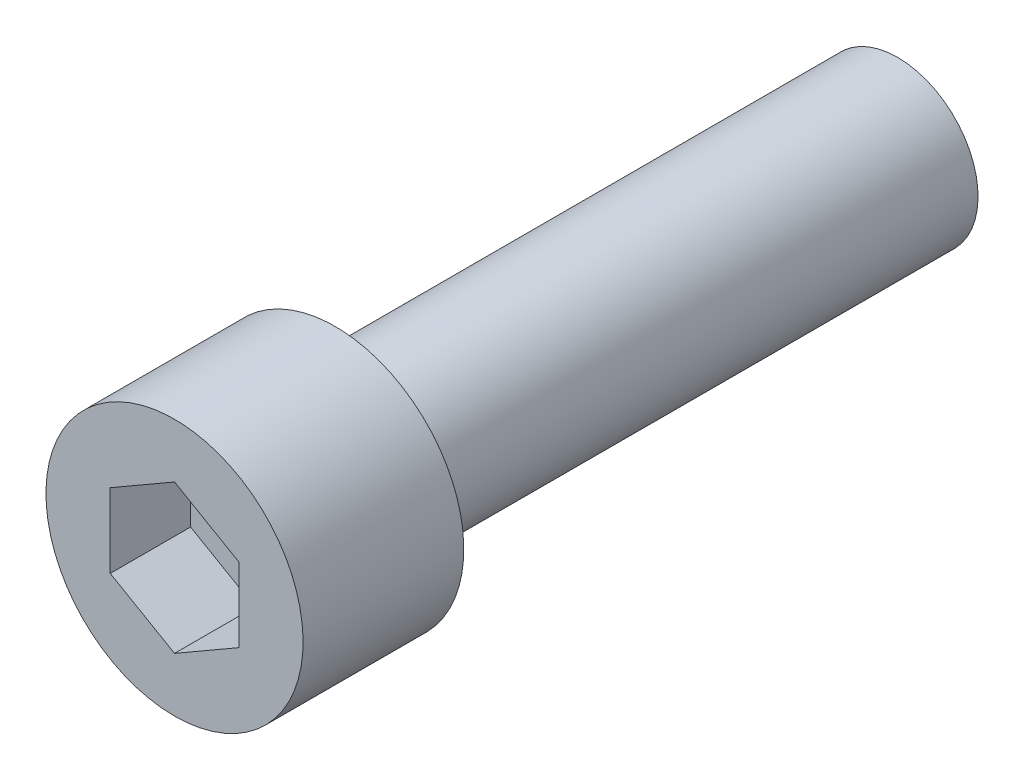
ISO-10303-21;
HEADER;
FILE_DESCRIPTION(('STEP AP214'),'2;1');
FILE_NAME('part.step','',(''),(''),'','','');
FILE_SCHEMA(('AUTOMOTIVE_DESIGN { 1 0 10303 214 1 1 1 1 }'));
ENDSEC;
DATA;
#1=APPLICATION_CONTEXT('core data for automotive mechanical design processes');
#2=APPLICATION_PROTOCOL_DEFINITION('international standard','automotive_design',2000,#1);
#3=PRODUCT_CONTEXT('',#1,'mechanical');
#4=PRODUCT('Part','Part','',(#3));
#5=PRODUCT_RELATED_PRODUCT_CATEGORY('part','',(#4));
#6=PRODUCT_DEFINITION_FORMATION('','',#4);
#7=PRODUCT_DEFINITION_CONTEXT('part definition',#1,'design');
#8=PRODUCT_DEFINITION('design','',#6,#7);
#9=PRODUCT_DEFINITION_SHAPE('','',#8);
#10=(LENGTH_UNIT() NAMED_UNIT(*) SI_UNIT(.MILLI.,.METRE.));
#11=(NAMED_UNIT(*) PLANE_ANGLE_UNIT() SI_UNIT($,.RADIAN.));
#12=(NAMED_UNIT(*) SI_UNIT($,.STERADIAN.) SOLID_ANGLE_UNIT());
#13=UNCERTAINTY_MEASURE_WITH_UNIT(LENGTH_MEASURE(1.E-05),#10,'distance_accuracy_value','');
#14=(GEOMETRIC_REPRESENTATION_CONTEXT(3) GLOBAL_UNCERTAINTY_ASSIGNED_CONTEXT((#13)) GLOBAL_UNIT_ASSIGNED_CONTEXT((#10,
#11,#12)) REPRESENTATION_CONTEXT('',''));
#15=CARTESIAN_POINT('',(0.,0.,0.));
#16=DIRECTION('',(0.,0.,1.));
#17=DIRECTION('',(1.,0.,0.));
#18=AXIS2_PLACEMENT_3D('',#15,#16,#17);
#19=CARTESIAN_POINT('',(0.,0.,0.));
#20=DIRECTION('',(0.,0.,-1.));
#21=DIRECTION('',(0.,1.,0.));
#22=AXIS2_PLACEMENT_3D('',#19,#20,#21);
#23=CYLINDRICAL_SURFACE('',#22,5.);
#24=CARTESIAN_POINT('',(0.,0.,0.));
#25=DIRECTION('',(0.,0.,1.));
#26=DIRECTION('',(0.,-1.,0.));
#27=AXIS2_PLACEMENT_3D('',#24,#25,#26);
#28=CIRCLE('',#27,5.);
#29=CARTESIAN_POINT('',(0.,-5.,0.));
#30=VERTEX_POINT('',#29);
#31=EDGE_CURVE('E9',#30,#30,#28,.T.);
#32=ORIENTED_EDGE('',*,*,#31,.F.);
#33=EDGE_LOOP('',(#32));
#34=FACE_BOUND('',#33,.T.);
#35=CARTESIAN_POINT('',(0.,0.,-35.));
#36=DIRECTION('',(0.,0.,-1.));
#37=DIRECTION('',(0.,1.,0.));
#38=AXIS2_PLACEMENT_3D('',#35,#36,#37);
#39=CIRCLE('',#38,5.);
#40=CARTESIAN_POINT('',(0.,5.,-35.));
#41=VERTEX_POINT('',#40);
#42=EDGE_CURVE('E143',#41,#41,#39,.T.);
#43=ORIENTED_EDGE('',*,*,#42,.F.);
#44=EDGE_LOOP('',(#43));
#45=FACE_BOUND('',#44,.T.);
#46=ADVANCED_FACE('F15',(#34,#45),#23,.T.);
#47=CARTESIAN_POINT('',(0.,0.,0.));
#48=DIRECTION('',(0.,0.,1.));
#49=DIRECTION('',(0.,-1.,0.));
#50=AXIS2_PLACEMENT_3D('',#47,#48,#49);
#51=PLANE('',#50);
#52=CARTESIAN_POINT('',(0.,0.,0.));
#53=DIRECTION('',(0.,0.,1.));
#54=DIRECTION('',(0.,-1.,0.));
#55=AXIS2_PLACEMENT_3D('',#52,#53,#54);
#56=CIRCLE('',#55,8.);
#57=CARTESIAN_POINT('',(0.,-8.,0.));
#58=VERTEX_POINT('',#57);
#59=EDGE_CURVE('E117',#58,#58,#56,.T.);
#60=ORIENTED_EDGE('',*,*,#59,.F.);
#61=EDGE_LOOP('',(#60));
#62=FACE_BOUND('',#61,.T.);
#63=ORIENTED_EDGE('',*,*,#31,.T.);
#64=EDGE_LOOP('',(#63));
#65=FACE_BOUND('',#64,.T.);
#66=ADVANCED_FACE('F131',(#62,#65),#51,.F.);
#67=CARTESIAN_POINT('',(0.,0.,10.));
#68=DIRECTION('',(0.,0.,-1.));
#69=DIRECTION('',(0.,1.,0.));
#70=AXIS2_PLACEMENT_3D('',#67,#68,#69);
#71=CYLINDRICAL_SURFACE('',#70,8.);
#72=CARTESIAN_POINT('',(0.,0.,10.));
#73=DIRECTION('',(0.,0.,1.));
#74=DIRECTION('',(0.,-1.,0.));
#75=AXIS2_PLACEMENT_3D('',#72,#73,#74);
#76=CIRCLE('',#75,8.);
#77=CARTESIAN_POINT('',(0.,-8.,10.));
#78=VERTEX_POINT('',#77);
#79=EDGE_CURVE('E22',#78,#78,#76,.T.);
#80=ORIENTED_EDGE('',*,*,#79,.F.);
#81=EDGE_LOOP('',(#80));
#82=FACE_BOUND('',#81,.T.);
#83=ORIENTED_EDGE('',*,*,#59,.T.);
#84=EDGE_LOOP('',(#83));
#85=FACE_BOUND('',#84,.T.);
#86=ADVANCED_FACE('F128',(#82,#85),#71,.T.);
#87=CARTESIAN_POINT('',(0.,0.,10.));
#88=DIRECTION('',(0.,0.,1.));
#89=DIRECTION('',(0.,-1.,0.));
#90=AXIS2_PLACEMENT_3D('',#87,#88,#89);
#91=PLANE('',#90);
#92=DIRECTION('',(0.866025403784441,-0.5,0.));
#93=VECTOR('',#92,1.);
#94=CARTESIAN_POINT('',(-4.,-2.30940107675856,10.));
#95=LINE('',#94,#93);
#96=CARTESIAN_POINT('',(-4.,-2.30940107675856,10.));
#97=VERTEX_POINT('',#96);
#98=CARTESIAN_POINT('',(0.,-4.61880215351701,10.));
#99=VERTEX_POINT('',#98);
#100=EDGE_CURVE('E29',#97,#99,#95,.T.);
#101=ORIENTED_EDGE('',*,*,#100,.F.);
#102=DIRECTION('',(0.,-1.,0.));
#103=VECTOR('',#102,1.);
#104=CARTESIAN_POINT('',(-4.,2.30940107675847,10.));
#105=LINE('',#104,#103);
#106=CARTESIAN_POINT('',(-4.,2.30940107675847,10.));
#107=VERTEX_POINT('',#106);
#108=EDGE_CURVE('E99',#107,#97,#105,.T.);
#109=ORIENTED_EDGE('',*,*,#108,.F.);
#110=DIRECTION('',(-0.866025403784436,-0.5,0.));
#111=VECTOR('',#110,1.);
#112=CARTESIAN_POINT('',(0.,4.61880215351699,10.));
#113=LINE('',#112,#111);
#114=CARTESIAN_POINT('',(0.,4.61880215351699,10.));
#115=VERTEX_POINT('',#114);
#116=EDGE_CURVE('E93',#115,#107,#113,.T.);
#117=ORIENTED_EDGE('',*,*,#116,.F.);
#118=DIRECTION('',(-0.866025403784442,0.5,0.));
#119=VECTOR('',#118,1.);
#120=CARTESIAN_POINT('',(4.,2.30940107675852,10.));
#121=LINE('',#120,#119);
#122=CARTESIAN_POINT('',(4.,2.30940107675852,10.));
#123=VERTEX_POINT('',#122);
#124=EDGE_CURVE('E91',#123,#115,#121,.T.);
#125=ORIENTED_EDGE('',*,*,#124,.F.);
#126=DIRECTION('',(0.,1.,0.));
#127=VECTOR('',#126,1.);
#128=CARTESIAN_POINT('',(4.,-2.30940107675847,10.));
#129=LINE('',#128,#127);
#130=CARTESIAN_POINT('',(4.,-2.30940107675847,10.));
#131=VERTEX_POINT('',#130);
#132=EDGE_CURVE('E72',#131,#123,#129,.T.);
#133=ORIENTED_EDGE('',*,*,#132,.F.);
#134=DIRECTION('',(0.866025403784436,0.5,0.));
#135=VECTOR('',#134,1.);
#136=CARTESIAN_POINT('',(0.,-4.61880215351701,10.));
#137=LINE('',#136,#135);
#138=EDGE_CURVE('E83',#99,#131,#137,.T.);
#139=ORIENTED_EDGE('',*,*,#138,.F.);
#140=EDGE_LOOP('',(#101,#109,#117,#125,#133,#139));
#141=FACE_BOUND('',#140,.T.);
#142=ORIENTED_EDGE('',*,*,#79,.T.);
#143=EDGE_LOOP('',(#142));
#144=FACE_BOUND('',#143,.T.);
#145=ADVANCED_FACE('F87',(#141,#144),#91,.T.);
#146=CARTESIAN_POINT('',(-4.,-2.30940107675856,5.));
#147=DIRECTION('',(-0.5,-0.866025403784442,0.));
#148=DIRECTION('',(0.866025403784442,-0.5,0.));
#149=AXIS2_PLACEMENT_3D('',#146,#147,#148);
#150=PLANE('',#149);
#151=ORIENTED_EDGE('',*,*,#100,.T.);
#152=DIRECTION('',(0.,0.,1.));
#153=VECTOR('',#152,1.);
#154=CARTESIAN_POINT('',(0.,-4.61880215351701,5.));
#155=LINE('',#154,#153);
#156=CARTESIAN_POINT('',(0.,-4.61880215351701,5.));
#157=VERTEX_POINT('',#156);
#158=EDGE_CURVE('E80',#157,#99,#155,.T.);
#159=ORIENTED_EDGE('',*,*,#158,.F.);
#160=DIRECTION('',(0.866025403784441,-0.5,0.));
#161=VECTOR('',#160,1.);
#162=CARTESIAN_POINT('',(-4.,-2.30940107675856,5.));
#163=LINE('',#162,#161);
#164=CARTESIAN_POINT('',(-4.,-2.30940107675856,5.));
#165=VERTEX_POINT('',#164);
#166=EDGE_CURVE('E101',#165,#157,#163,.T.);
#167=ORIENTED_EDGE('',*,*,#166,.F.);
#168=DIRECTION('',(0.,0.,1.));
#169=VECTOR('',#168,1.);
#170=CARTESIAN_POINT('',(-4.,-2.30940107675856,5.));
#171=LINE('',#170,#169);
#172=EDGE_CURVE('E36',#165,#97,#171,.T.);
#173=ORIENTED_EDGE('',*,*,#172,.T.);
#174=EDGE_LOOP('',(#151,#159,#167,#173));
#175=FACE_BOUND('',#174,.T.);
#176=ADVANCED_FACE('F162',(#175),#150,.F.);
#177=CARTESIAN_POINT('',(-4.,2.30940107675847,5.));
#178=DIRECTION('',(-1.,0.,0.));
#179=DIRECTION('',(0.,-1.,0.));
#180=AXIS2_PLACEMENT_3D('',#177,#178,#179);
#181=PLANE('',#180);
#182=ORIENTED_EDGE('',*,*,#108,.T.);
#183=ORIENTED_EDGE('',*,*,#172,.F.);
#184=DIRECTION('',(0.,-1.,0.));
#185=VECTOR('',#184,1.);
#186=CARTESIAN_POINT('',(-4.,2.30940107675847,5.));
#187=LINE('',#186,#185);
#188=CARTESIAN_POINT('',(-4.,2.30940107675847,5.));
#189=VERTEX_POINT('',#188);
#190=EDGE_CURVE('E113',#189,#165,#187,.T.);
#191=ORIENTED_EDGE('',*,*,#190,.F.);
#192=DIRECTION('',(0.,0.,1.));
#193=VECTOR('',#192,1.);
#194=CARTESIAN_POINT('',(-4.,2.30940107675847,5.));
#195=LINE('',#194,#193);
#196=EDGE_CURVE('E118',#189,#107,#195,.T.);
#197=ORIENTED_EDGE('',*,*,#196,.T.);
#198=EDGE_LOOP('',(#182,#183,#191,#197));
#199=FACE_BOUND('',#198,.T.);
#200=ADVANCED_FACE('F158',(#199),#181,.F.);
#201=CARTESIAN_POINT('',(0.,4.61880215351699,5.));
#202=DIRECTION('',(-0.5,0.866025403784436,0.));
#203=DIRECTION('',(-0.866025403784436,-0.5,0.));
#204=AXIS2_PLACEMENT_3D('',#201,#202,#203);
#205=PLANE('',#204);
#206=ORIENTED_EDGE('',*,*,#116,.T.);
#207=ORIENTED_EDGE('',*,*,#196,.F.);
#208=DIRECTION('',(-0.866025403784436,-0.5,0.));
#209=VECTOR('',#208,1.);
#210=CARTESIAN_POINT('',(0.,4.61880215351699,5.));
#211=LINE('',#210,#209);
#212=CARTESIAN_POINT('',(0.,4.61880215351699,5.));
#213=VERTEX_POINT('',#212);
#214=EDGE_CURVE('E110',#213,#189,#211,.T.);
#215=ORIENTED_EDGE('',*,*,#214,.F.);
#216=DIRECTION('',(0.,0.,1.));
#217=VECTOR('',#216,1.);
#218=CARTESIAN_POINT('',(0.,4.61880215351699,5.));
#219=LINE('',#218,#217);
#220=EDGE_CURVE('E120',#213,#115,#219,.T.);
#221=ORIENTED_EDGE('',*,*,#220,.T.);
#222=EDGE_LOOP('',(#206,#207,#215,#221));
#223=FACE_BOUND('',#222,.T.);
#224=ADVANCED_FACE('F161',(#223),#205,.F.);
#225=CARTESIAN_POINT('',(4.,2.30940107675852,5.));
#226=DIRECTION('',(0.5,0.866025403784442,0.));
#227=DIRECTION('',(-0.866025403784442,0.5,0.));
#228=AXIS2_PLACEMENT_3D('',#225,#226,#227);
#229=PLANE('',#228);
#230=ORIENTED_EDGE('',*,*,#124,.T.);
#231=ORIENTED_EDGE('',*,*,#220,.F.);
#232=DIRECTION('',(-0.866025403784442,0.5,0.));
#233=VECTOR('',#232,1.);
#234=CARTESIAN_POINT('',(4.,2.30940107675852,5.));
#235=LINE('',#234,#233);
#236=CARTESIAN_POINT('',(4.,2.30940107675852,5.));
#237=VERTEX_POINT('',#236);
#238=EDGE_CURVE('E107',#237,#213,#235,.T.);
#239=ORIENTED_EDGE('',*,*,#238,.F.);
#240=DIRECTION('',(0.,0.,1.));
#241=VECTOR('',#240,1.);
#242=CARTESIAN_POINT('',(4.,2.30940107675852,5.));
#243=LINE('',#242,#241);
#244=EDGE_CURVE('E79',#237,#123,#243,.T.);
#245=ORIENTED_EDGE('',*,*,#244,.T.);
#246=EDGE_LOOP('',(#230,#231,#239,#245));
#247=FACE_BOUND('',#246,.T.);
#248=ADVANCED_FACE('F165',(#247),#229,.F.);
#249=CARTESIAN_POINT('',(4.,-2.30940107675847,5.));
#250=DIRECTION('',(1.,0.,0.));
#251=DIRECTION('',(0.,1.,0.));
#252=AXIS2_PLACEMENT_3D('',#249,#250,#251);
#253=PLANE('',#252);
#254=ORIENTED_EDGE('',*,*,#132,.T.);
#255=ORIENTED_EDGE('',*,*,#244,.F.);
#256=DIRECTION('',(0.,1.,0.));
#257=VECTOR('',#256,1.);
#258=CARTESIAN_POINT('',(4.,-2.30940107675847,5.));
#259=LINE('',#258,#257);
#260=CARTESIAN_POINT('',(4.,-2.30940107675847,5.));
#261=VERTEX_POINT('',#260);
#262=EDGE_CURVE('E75',#261,#237,#259,.T.);
#263=ORIENTED_EDGE('',*,*,#262,.F.);
#264=DIRECTION('',(0.,0.,1.));
#265=VECTOR('',#264,1.);
#266=CARTESIAN_POINT('',(4.,-2.30940107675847,5.));
#267=LINE('',#266,#265);
#268=EDGE_CURVE('E68',#261,#131,#267,.T.);
#269=ORIENTED_EDGE('',*,*,#268,.T.);
#270=EDGE_LOOP('',(#254,#255,#263,#269));
#271=FACE_BOUND('',#270,.T.);
#272=ADVANCED_FACE('F70',(#271),#253,.F.);
#273=CARTESIAN_POINT('',(0.,-4.61880215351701,5.));
#274=DIRECTION('',(0.5,-0.866025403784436,0.));
#275=DIRECTION('',(0.866025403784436,0.5,0.));
#276=AXIS2_PLACEMENT_3D('',#273,#274,#275);
#277=PLANE('',#276);
#278=ORIENTED_EDGE('',*,*,#138,.T.);
#279=ORIENTED_EDGE('',*,*,#268,.F.);
#280=DIRECTION('',(0.866025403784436,0.5,0.));
#281=VECTOR('',#280,1.);
#282=CARTESIAN_POINT('',(0.,-4.61880215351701,5.));
#283=LINE('',#282,#281);
#284=EDGE_CURVE('E104',#157,#261,#283,.T.);
#285=ORIENTED_EDGE('',*,*,#284,.F.);
#286=ORIENTED_EDGE('',*,*,#158,.T.);
#287=EDGE_LOOP('',(#278,#279,#285,#286));
#288=FACE_BOUND('',#287,.T.);
#289=ADVANCED_FACE('F84',(#288),#277,.F.);
#290=CARTESIAN_POINT('',(0.,-4.61880215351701,5.));
#291=DIRECTION('',(0.,0.,1.));
#292=DIRECTION('',(0.,-1.,0.));
#293=AXIS2_PLACEMENT_3D('',#290,#291,#292);
#294=PLANE('',#293);
#295=ORIENTED_EDGE('',*,*,#166,.T.);
#296=ORIENTED_EDGE('',*,*,#284,.T.);
#297=ORIENTED_EDGE('',*,*,#262,.T.);
#298=ORIENTED_EDGE('',*,*,#238,.T.);
#299=ORIENTED_EDGE('',*,*,#214,.T.);
#300=ORIENTED_EDGE('',*,*,#190,.T.);
#301=EDGE_LOOP('',(#295,#296,#297,#298,#299,#300));
#302=FACE_BOUND('',#301,.T.);
#303=ADVANCED_FACE('F148',(#302),#294,.T.);
#304=CARTESIAN_POINT('',(0.,0.,-35.));
#305=DIRECTION('',(0.,0.,-1.));
#306=DIRECTION('',(0.,1.,0.));
#307=AXIS2_PLACEMENT_3D('',#304,#305,#306);
#308=PLANE('',#307);
#309=ORIENTED_EDGE('',*,*,#42,.T.);
#310=EDGE_LOOP('',(#309));
#311=FACE_BOUND('',#310,.T.);
#312=ADVANCED_FACE('F146',(#311),#308,.T.);
#313=CLOSED_SHELL('',(#46,#66,#86,#145,#176,#200,#224,#248,#272,#289,#303,#312));
#314=MANIFOLD_SOLID_BREP('B1',#313);
#315=ADVANCED_BREP_SHAPE_REPRESENTATION('',(#18,#314),#14);
#316=SHAPE_DEFINITION_REPRESENTATION(#9,#315);
ENDSEC;
END-ISO-10303-21;
